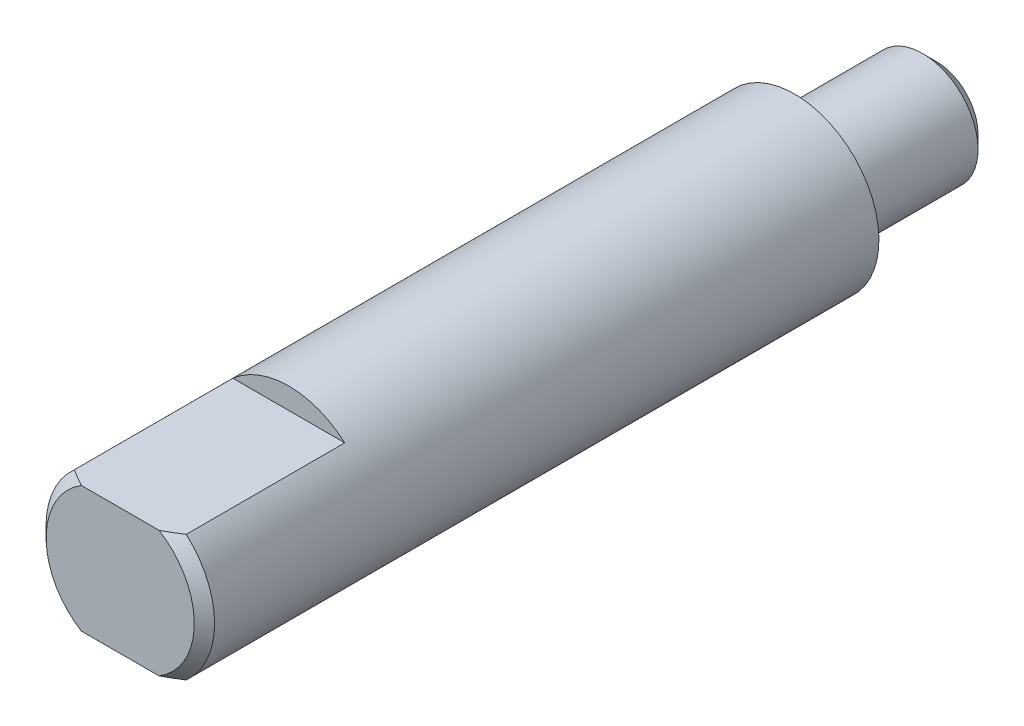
from build123d import *

# Parameters (mm, degrees)
SKETCH2_W          = 6.35
SKETCH2_H          = 0.8
CUT_EXTRUDE1_DEPTH = 5


with BuildPart() as part:
    # Sketch1 → Revolve1 (revolve)
    with BuildSketch(Plane(origin=(0, 0, 0), x_dir=(0, 0, -1), z_dir=(1, 0, 0)), mode=Mode.PRIVATE) as revolve1_sk:
        Polygon((26.67, 1.57), (26.16, 2.0828), (21.336, 2.0828), (21.336, 3.175), (-3.684, 3.175), (-4.064, 2.79), (-4.064, 0), (26.67, 0), align=None)
    revolve(revolve1_sk.sketch.rotate(Axis((0, 0, 4.064), (0, 0, -1)), 180), axis=Axis((0, 0, 4.064), (0, 0, -1)))

    # Sketch2 → Cut-Extrude1 (cut, symmetric)
    with BuildSketch(Plane(origin=(0, 0, 0), x_dir=(0, 0, -1), z_dir=(1, 0, 0))):
        with Locations((-0.889, 2.775)):
            Rectangle(SKETCH2_W, SKETCH2_H)
        with Locations((-0.889, -2.775)):
            Rectangle(SKETCH2_W, SKETCH2_H)
    extrude(amount=CUT_EXTRUDE1_DEPTH, both=True, mode=Mode.SUBTRACT)


solid = part.part
